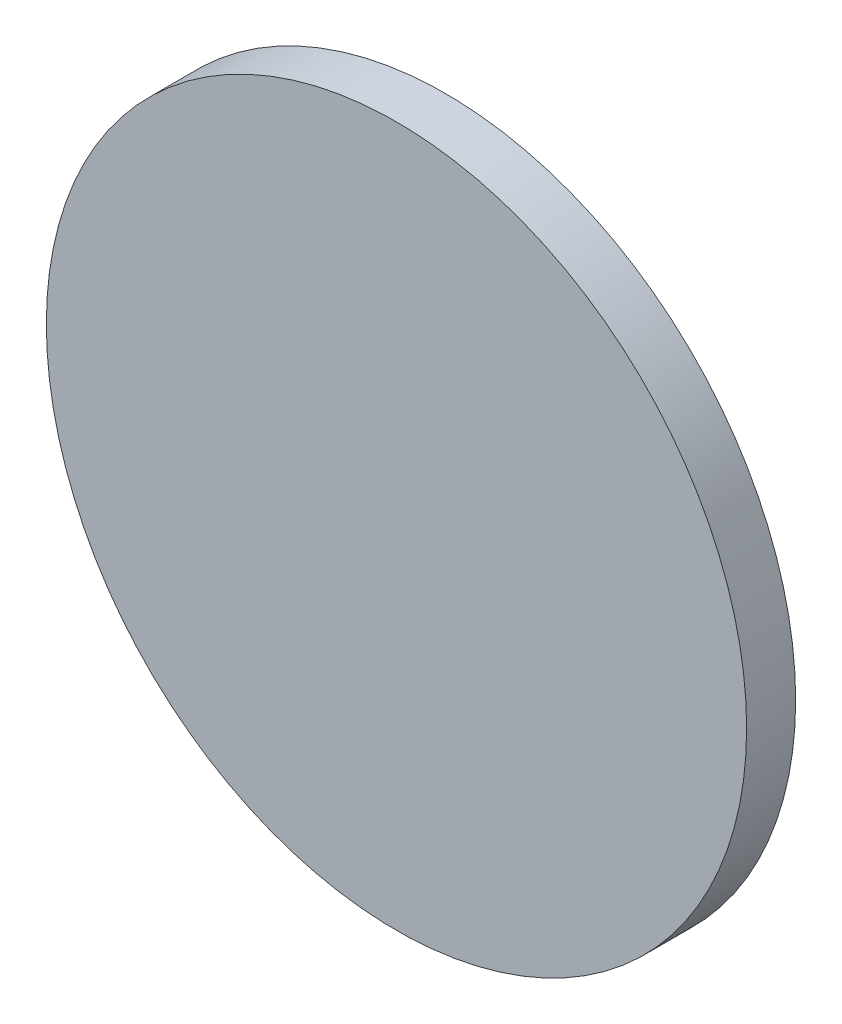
from build123d import *

# Parameters (mm, degrees)
ESQUISSE1_R      = 50
EXTRUSION1_DEPTH = 7


with BuildPart() as part:
    # Esquisse1 → Extrusion1 (new body)
    with BuildSketch(Plane.XY):
        with Locations((142, 0)):
            Circle(ESQUISSE1_R)
    extrude(amount=EXTRUSION1_DEPTH)


solid = part.part
